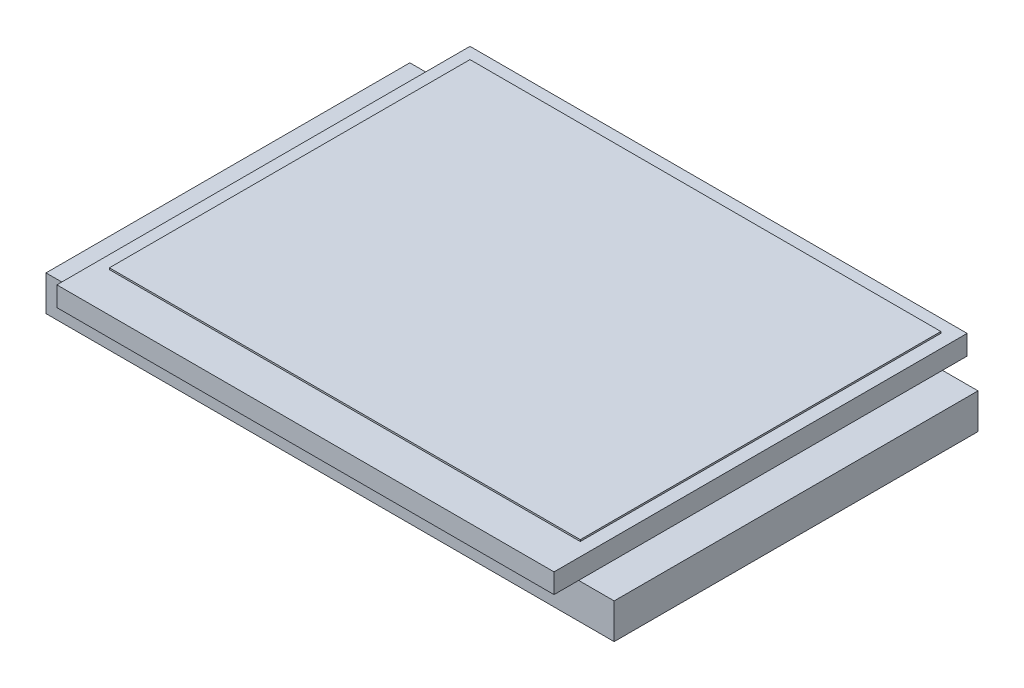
ISO-10303-21;
HEADER;
FILE_DESCRIPTION(('STEP AP214'),'2;1');
FILE_NAME('part.step','',(''),(''),'','','');
FILE_SCHEMA(('AUTOMOTIVE_DESIGN { 1 0 10303 214 1 1 1 1 }'));
ENDSEC;
DATA;
#1=APPLICATION_CONTEXT('core data for automotive mechanical design processes');
#2=APPLICATION_PROTOCOL_DEFINITION('international standard','automotive_design',2000,#1);
#3=PRODUCT_CONTEXT('',#1,'mechanical');
#4=PRODUCT('Part','Part','',(#3));
#5=PRODUCT_RELATED_PRODUCT_CATEGORY('part','',(#4));
#6=PRODUCT_DEFINITION_FORMATION('','',#4);
#7=PRODUCT_DEFINITION_CONTEXT('part definition',#1,'design');
#8=PRODUCT_DEFINITION('design','',#6,#7);
#9=PRODUCT_DEFINITION_SHAPE('','',#8);
#10=(LENGTH_UNIT() NAMED_UNIT(*) SI_UNIT(.MILLI.,.METRE.));
#11=(NAMED_UNIT(*) PLANE_ANGLE_UNIT() SI_UNIT($,.RADIAN.));
#12=(NAMED_UNIT(*) SI_UNIT($,.STERADIAN.) SOLID_ANGLE_UNIT());
#13=UNCERTAINTY_MEASURE_WITH_UNIT(LENGTH_MEASURE(1.E-05),#10,'distance_accuracy_value','');
#14=(GEOMETRIC_REPRESENTATION_CONTEXT(3) GLOBAL_UNCERTAINTY_ASSIGNED_CONTEXT((#13)) GLOBAL_UNIT_ASSIGNED_CONTEXT((#10,
#11,#12)) REPRESENTATION_CONTEXT('',''));
#15=CARTESIAN_POINT('',(0.,0.,0.));
#16=DIRECTION('',(0.,0.,1.));
#17=DIRECTION('',(1.,0.,0.));
#18=AXIS2_PLACEMENT_3D('',#15,#16,#17);
#19=CARTESIAN_POINT('',(0.,0.,0.));
#20=DIRECTION('',(0.,1.,0.));
#21=DIRECTION('',(0.,0.,1.));
#22=AXIS2_PLACEMENT_3D('',#19,#20,#21);
#23=PLANE('',#22);
#24=DIRECTION('',(1.,0.,0.));
#25=VECTOR('',#24,1.);
#26=CARTESIAN_POINT('',(-43.942,0.,-28.1400000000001));
#27=LINE('',#26,#25);
#28=CARTESIAN_POINT('',(-38.4499999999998,0.,-28.1400000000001));
#29=VERTEX_POINT('',#28);
#30=CARTESIAN_POINT('',(38.4500000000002,0.,-28.1400000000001));
#31=VERTEX_POINT('',#30);
#32=EDGE_CURVE('E11',#29,#31,#27,.T.);
#33=ORIENTED_EDGE('',*,*,#32,.F.);
#34=DIRECTION('',(0.,0.,1.));
#35=VECTOR('',#34,1.);
#36=CARTESIAN_POINT('',(-38.4499999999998,0.,31.9499999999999));
#37=LINE('',#36,#35);
#38=CARTESIAN_POINT('',(-38.4499999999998,0.,-31.9500000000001));
#39=VERTEX_POINT('',#38);
#40=EDGE_CURVE('E212',#39,#29,#37,.T.);
#41=ORIENTED_EDGE('',*,*,#40,.F.);
#42=DIRECTION('',(-1.,0.,0.));
#43=VECTOR('',#42,1.);
#44=CARTESIAN_POINT('',(38.4500000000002,0.,-31.9500000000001));
#45=LINE('',#44,#43);
#46=CARTESIAN_POINT('',(38.4500000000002,0.,-31.9500000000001));
#47=VERTEX_POINT('',#46);
#48=EDGE_CURVE('E205',#47,#39,#45,.T.);
#49=ORIENTED_EDGE('',*,*,#48,.F.);
#50=DIRECTION('',(0.,0.,-1.));
#51=VECTOR('',#50,1.);
#52=CARTESIAN_POINT('',(38.4500000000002,0.,31.9499999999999));
#53=LINE('',#52,#51);
#54=EDGE_CURVE('E54',#31,#47,#53,.T.);
#55=ORIENTED_EDGE('',*,*,#54,.F.);
#56=EDGE_LOOP('',(#33,#41,#49,#55));
#57=FACE_BOUND('',#56,.T.);
#58=ADVANCED_FACE('F35',(#57),#23,.F.);
#59=DIRECTION('',(-1.,0.,0.));
#60=VECTOR('',#59,1.);
#61=CARTESIAN_POINT('',(-43.942,0.,28.1399999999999));
#62=LINE('',#61,#60);
#63=CARTESIAN_POINT('',(38.4500000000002,0.,28.1399999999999));
#64=VERTEX_POINT('',#63);
#65=CARTESIAN_POINT('',(-38.4499999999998,0.,28.1399999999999));
#66=VERTEX_POINT('',#65);
#67=EDGE_CURVE('E44',#64,#66,#62,.T.);
#68=ORIENTED_EDGE('',*,*,#67,.F.);
#69=CARTESIAN_POINT('',(38.4500000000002,0.,31.9499999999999));
#70=VERTEX_POINT('',#69);
#71=EDGE_CURVE('E218',#70,#64,#53,.T.);
#72=ORIENTED_EDGE('',*,*,#71,.F.);
#73=DIRECTION('',(1.,0.,0.));
#74=VECTOR('',#73,1.);
#75=CARTESIAN_POINT('',(38.4500000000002,0.,31.9499999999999));
#76=LINE('',#75,#74);
#77=CARTESIAN_POINT('',(-38.4499999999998,0.,31.9499999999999));
#78=VERTEX_POINT('',#77);
#79=EDGE_CURVE('E215',#78,#70,#76,.T.);
#80=ORIENTED_EDGE('',*,*,#79,.F.);
#81=EDGE_CURVE('E200',#66,#78,#37,.T.);
#82=ORIENTED_EDGE('',*,*,#81,.F.);
#83=EDGE_LOOP('',(#68,#72,#80,#82));
#84=FACE_BOUND('',#83,.T.);
#85=ADVANCED_FACE('F261',(#84),#23,.F.);
#86=CARTESIAN_POINT('',(0.,3.048,0.));
#87=DIRECTION('',(0.,1.,0.));
#88=DIRECTION('',(0.,0.,1.));
#89=AXIS2_PLACEMENT_3D('',#86,#87,#88);
#90=PLANE('',#89);
#91=DIRECTION('',(0.,0.,1.));
#92=VECTOR('',#91,1.);
#93=CARTESIAN_POINT('',(-38.4499999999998,3.048,31.9499999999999));
#94=LINE('',#93,#92);
#95=CARTESIAN_POINT('',(-38.4499999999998,3.048,-31.9500000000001));
#96=VERTEX_POINT('',#95);
#97=CARTESIAN_POINT('',(-38.4499999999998,3.048,31.9499999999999));
#98=VERTEX_POINT('',#97);
#99=EDGE_CURVE('E201',#96,#98,#94,.T.);
#100=ORIENTED_EDGE('',*,*,#99,.T.);
#101=DIRECTION('',(1.,0.,0.));
#102=VECTOR('',#101,1.);
#103=CARTESIAN_POINT('',(38.4500000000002,3.048,31.9499999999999));
#104=LINE('',#103,#102);
#105=CARTESIAN_POINT('',(38.4500000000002,3.048,31.9499999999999));
#106=VERTEX_POINT('',#105);
#107=EDGE_CURVE('E204',#98,#106,#104,.T.);
#108=ORIENTED_EDGE('',*,*,#107,.T.);
#109=DIRECTION('',(0.,0.,-1.));
#110=VECTOR('',#109,1.);
#111=CARTESIAN_POINT('',(38.4500000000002,3.048,31.9499999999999));
#112=LINE('',#111,#110);
#113=CARTESIAN_POINT('',(38.4500000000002,3.048,-31.9500000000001));
#114=VERTEX_POINT('',#113);
#115=EDGE_CURVE('E207',#106,#114,#112,.T.);
#116=ORIENTED_EDGE('',*,*,#115,.T.);
#117=DIRECTION('',(-1.,0.,0.));
#118=VECTOR('',#117,1.);
#119=CARTESIAN_POINT('',(38.4500000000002,3.048,-31.9500000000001));
#120=LINE('',#119,#118);
#121=EDGE_CURVE('E209',#114,#96,#120,.T.);
#122=ORIENTED_EDGE('',*,*,#121,.T.);
#123=EDGE_LOOP('',(#100,#108,#116,#122));
#124=FACE_BOUND('',#123,.T.);
#125=DIRECTION('',(-1.,0.,0.));
#126=VECTOR('',#125,1.);
#127=CARTESIAN_POINT('',(-36.4179999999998,3.048,-29.9180000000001));
#128=LINE('',#127,#126);
#129=CARTESIAN_POINT('',(36.4180000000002,3.048,-29.9180000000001));
#130=VERTEX_POINT('',#129);
#131=CARTESIAN_POINT('',(-36.4179999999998,3.048,-29.9180000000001));
#132=VERTEX_POINT('',#131);
#133=EDGE_CURVE('E169',#130,#132,#128,.T.);
#134=ORIENTED_EDGE('',*,*,#133,.F.);
#135=DIRECTION('',(0.,0.,-1.));
#136=VECTOR('',#135,1.);
#137=CARTESIAN_POINT('',(36.4180000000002,3.048,-29.9180000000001));
#138=LINE('',#137,#136);
#139=CARTESIAN_POINT('',(36.4180000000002,3.048,25.8539999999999));
#140=VERTEX_POINT('',#139);
#141=EDGE_CURVE('E166',#140,#130,#138,.T.);
#142=ORIENTED_EDGE('',*,*,#141,.F.);
#143=DIRECTION('',(1.,0.,0.));
#144=VECTOR('',#143,1.);
#145=CARTESIAN_POINT('',(-36.4179999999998,3.048,25.8539999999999));
#146=LINE('',#145,#144);
#147=CARTESIAN_POINT('',(-36.4179999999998,3.048,25.8539999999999));
#148=VERTEX_POINT('',#147);
#149=EDGE_CURVE('E179',#148,#140,#146,.T.);
#150=ORIENTED_EDGE('',*,*,#149,.F.);
#151=DIRECTION('',(0.,0.,1.));
#152=VECTOR('',#151,1.);
#153=CARTESIAN_POINT('',(-36.4179999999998,3.048,-29.9180000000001));
#154=LINE('',#153,#152);
#155=EDGE_CURVE('E187',#132,#148,#154,.T.);
#156=ORIENTED_EDGE('',*,*,#155,.F.);
#157=EDGE_LOOP('',(#134,#142,#150,#156));
#158=FACE_BOUND('',#157,.T.);
#159=ADVANCED_FACE('F267',(#124,#158),#90,.T.);
#160=CARTESIAN_POINT('',(-38.4499999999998,3.048,31.9499999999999));
#161=DIRECTION('',(1.,0.,0.));
#162=DIRECTION('',(0.,0.,-1.));
#163=AXIS2_PLACEMENT_3D('',#160,#161,#162);
#164=PLANE('',#163);
#165=ORIENTED_EDGE('',*,*,#40,.T.);
#166=EDGE_CURVE('E216',#29,#66,#37,.T.);
#167=ORIENTED_EDGE('',*,*,#166,.T.);
#168=ORIENTED_EDGE('',*,*,#81,.T.);
#169=DIRECTION('',(0.,-1.,0.));
#170=VECTOR('',#169,1.);
#171=CARTESIAN_POINT('',(-38.4499999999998,3.048,31.9499999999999));
#172=LINE('',#171,#170);
#173=EDGE_CURVE('E39',#98,#78,#172,.T.);
#174=ORIENTED_EDGE('',*,*,#173,.F.);
#175=ORIENTED_EDGE('',*,*,#99,.F.);
#176=DIRECTION('',(0.,-1.,0.));
#177=VECTOR('',#176,1.);
#178=CARTESIAN_POINT('',(-38.4499999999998,3.048,-31.9500000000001));
#179=LINE('',#178,#177);
#180=EDGE_CURVE('E211',#96,#39,#179,.T.);
#181=ORIENTED_EDGE('',*,*,#180,.T.);
#182=EDGE_LOOP('',(#165,#167,#168,#174,#175,#181));
#183=FACE_BOUND('',#182,.T.);
#184=ADVANCED_FACE('F37',(#183),#164,.F.);
#185=CARTESIAN_POINT('',(38.4500000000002,3.048,31.9499999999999));
#186=DIRECTION('',(0.,0.,-1.));
#187=DIRECTION('',(-1.,0.,0.));
#188=AXIS2_PLACEMENT_3D('',#185,#186,#187);
#189=PLANE('',#188);
#190=ORIENTED_EDGE('',*,*,#79,.T.);
#191=DIRECTION('',(0.,-1.,0.));
#192=VECTOR('',#191,1.);
#193=CARTESIAN_POINT('',(38.4500000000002,3.048,31.9499999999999));
#194=LINE('',#193,#192);
#195=EDGE_CURVE('E226',#106,#70,#194,.T.);
#196=ORIENTED_EDGE('',*,*,#195,.F.);
#197=ORIENTED_EDGE('',*,*,#107,.F.);
#198=ORIENTED_EDGE('',*,*,#173,.T.);
#199=EDGE_LOOP('',(#190,#196,#197,#198));
#200=FACE_BOUND('',#199,.T.);
#201=ADVANCED_FACE('F262',(#200),#189,.F.);
#202=CARTESIAN_POINT('',(38.4500000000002,3.048,31.9499999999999));
#203=DIRECTION('',(-1.,0.,0.));
#204=DIRECTION('',(0.,0.,1.));
#205=AXIS2_PLACEMENT_3D('',#202,#203,#204);
#206=PLANE('',#205);
#207=ORIENTED_EDGE('',*,*,#71,.T.);
#208=EDGE_CURVE('E220',#64,#31,#53,.T.);
#209=ORIENTED_EDGE('',*,*,#208,.T.);
#210=ORIENTED_EDGE('',*,*,#54,.T.);
#211=DIRECTION('',(0.,-1.,0.));
#212=VECTOR('',#211,1.);
#213=CARTESIAN_POINT('',(38.4500000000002,3.048,-31.9500000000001));
#214=LINE('',#213,#212);
#215=EDGE_CURVE('E224',#114,#47,#214,.T.);
#216=ORIENTED_EDGE('',*,*,#215,.F.);
#217=ORIENTED_EDGE('',*,*,#115,.F.);
#218=ORIENTED_EDGE('',*,*,#195,.T.);
#219=EDGE_LOOP('',(#207,#209,#210,#216,#217,#218));
#220=FACE_BOUND('',#219,.T.);
#221=ADVANCED_FACE('F264',(#220),#206,.F.);
#222=CARTESIAN_POINT('',(38.4500000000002,3.048,-31.9500000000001));
#223=DIRECTION('',(0.,0.,1.));
#224=DIRECTION('',(1.,0.,0.));
#225=AXIS2_PLACEMENT_3D('',#222,#223,#224);
#226=PLANE('',#225);
#227=ORIENTED_EDGE('',*,*,#48,.T.);
#228=ORIENTED_EDGE('',*,*,#180,.F.);
#229=ORIENTED_EDGE('',*,*,#121,.F.);
#230=ORIENTED_EDGE('',*,*,#215,.T.);
#231=EDGE_LOOP('',(#227,#228,#229,#230));
#232=FACE_BOUND('',#231,.T.);
#233=ADVANCED_FACE('F272',(#232),#226,.F.);
#234=CARTESIAN_POINT('',(36.4180000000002,3.302,-29.9180000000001));
#235=DIRECTION('',(-1.,0.,0.));
#236=DIRECTION('',(0.,0.,1.));
#237=AXIS2_PLACEMENT_3D('',#234,#235,#236);
#238=PLANE('',#237);
#239=ORIENTED_EDGE('',*,*,#141,.T.);
#240=DIRECTION('',(0.,-1.,0.));
#241=VECTOR('',#240,1.);
#242=CARTESIAN_POINT('',(36.4180000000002,3.302,-29.9180000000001));
#243=LINE('',#242,#241);
#244=CARTESIAN_POINT('',(36.4180000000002,3.302,-29.9180000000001));
#245=VERTEX_POINT('',#244);
#246=EDGE_CURVE('E198',#245,#130,#243,.T.);
#247=ORIENTED_EDGE('',*,*,#246,.F.);
#248=DIRECTION('',(0.,0.,-1.));
#249=VECTOR('',#248,1.);
#250=CARTESIAN_POINT('',(36.4180000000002,3.302,-29.9180000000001));
#251=LINE('',#250,#249);
#252=CARTESIAN_POINT('',(36.4180000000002,3.302,25.8539999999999));
#253=VERTEX_POINT('',#252);
#254=EDGE_CURVE('E175',#253,#245,#251,.T.);
#255=ORIENTED_EDGE('',*,*,#254,.F.);
#256=DIRECTION('',(0.,-1.,0.));
#257=VECTOR('',#256,1.);
#258=CARTESIAN_POINT('',(36.4180000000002,3.302,25.8539999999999));
#259=LINE('',#258,#257);
#260=EDGE_CURVE('E184',#253,#140,#259,.T.);
#261=ORIENTED_EDGE('',*,*,#260,.T.);
#262=EDGE_LOOP('',(#239,#247,#255,#261));
#263=FACE_BOUND('',#262,.T.);
#264=ADVANCED_FACE('F274',(#263),#238,.F.);
#265=CARTESIAN_POINT('',(-36.4179999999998,3.302,-29.9180000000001));
#266=DIRECTION('',(0.,0.,1.));
#267=DIRECTION('',(1.,0.,0.));
#268=AXIS2_PLACEMENT_3D('',#265,#266,#267);
#269=PLANE('',#268);
#270=ORIENTED_EDGE('',*,*,#133,.T.);
#271=DIRECTION('',(0.,-1.,0.));
#272=VECTOR('',#271,1.);
#273=CARTESIAN_POINT('',(-36.4179999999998,3.302,-29.9180000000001));
#274=LINE('',#273,#272);
#275=CARTESIAN_POINT('',(-36.4179999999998,3.302,-29.9180000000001));
#276=VERTEX_POINT('',#275);
#277=EDGE_CURVE('E195',#276,#132,#274,.T.);
#278=ORIENTED_EDGE('',*,*,#277,.F.);
#279=DIRECTION('',(-1.,0.,0.));
#280=VECTOR('',#279,1.);
#281=CARTESIAN_POINT('',(-36.4179999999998,3.302,-29.9180000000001));
#282=LINE('',#281,#280);
#283=EDGE_CURVE('E178',#245,#276,#282,.T.);
#284=ORIENTED_EDGE('',*,*,#283,.F.);
#285=ORIENTED_EDGE('',*,*,#246,.T.);
#286=EDGE_LOOP('',(#270,#278,#284,#285));
#287=FACE_BOUND('',#286,.T.);
#288=ADVANCED_FACE('F280',(#287),#269,.F.);
#289=CARTESIAN_POINT('',(-36.4179999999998,3.302,-29.9180000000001));
#290=DIRECTION('',(1.,0.,0.));
#291=DIRECTION('',(0.,0.,-1.));
#292=AXIS2_PLACEMENT_3D('',#289,#290,#291);
#293=PLANE('',#292);
#294=ORIENTED_EDGE('',*,*,#155,.T.);
#295=DIRECTION('',(0.,-1.,0.));
#296=VECTOR('',#295,1.);
#297=CARTESIAN_POINT('',(-36.4179999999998,3.302,25.8539999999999));
#298=LINE('',#297,#296);
#299=CARTESIAN_POINT('',(-36.4179999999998,3.302,25.8539999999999));
#300=VERTEX_POINT('',#299);
#301=EDGE_CURVE('E193',#300,#148,#298,.T.);
#302=ORIENTED_EDGE('',*,*,#301,.F.);
#303=DIRECTION('',(0.,0.,1.));
#304=VECTOR('',#303,1.);
#305=CARTESIAN_POINT('',(-36.4179999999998,3.302,-29.9180000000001));
#306=LINE('',#305,#304);
#307=EDGE_CURVE('E181',#276,#300,#306,.T.);
#308=ORIENTED_EDGE('',*,*,#307,.F.);
#309=ORIENTED_EDGE('',*,*,#277,.T.);
#310=EDGE_LOOP('',(#294,#302,#308,#309));
#311=FACE_BOUND('',#310,.T.);
#312=ADVANCED_FACE('F294',(#311),#293,.F.);
#313=CARTESIAN_POINT('',(-36.4179999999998,3.302,25.8539999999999));
#314=DIRECTION('',(0.,0.,-1.));
#315=DIRECTION('',(-1.,0.,0.));
#316=AXIS2_PLACEMENT_3D('',#313,#314,#315);
#317=PLANE('',#316);
#318=ORIENTED_EDGE('',*,*,#149,.T.);
#319=ORIENTED_EDGE('',*,*,#260,.F.);
#320=DIRECTION('',(1.,0.,0.));
#321=VECTOR('',#320,1.);
#322=CARTESIAN_POINT('',(-36.4179999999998,3.302,25.8539999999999));
#323=LINE('',#322,#321);
#324=EDGE_CURVE('E183',#300,#253,#323,.T.);
#325=ORIENTED_EDGE('',*,*,#324,.F.);
#326=ORIENTED_EDGE('',*,*,#301,.T.);
#327=EDGE_LOOP('',(#318,#319,#325,#326));
#328=FACE_BOUND('',#327,.T.);
#329=ADVANCED_FACE('F298',(#328),#317,.F.);
#330=CARTESIAN_POINT('',(0.,3.302,0.));
#331=DIRECTION('',(0.,1.,0.));
#332=DIRECTION('',(0.,0.,1.));
#333=AXIS2_PLACEMENT_3D('',#330,#331,#332);
#334=PLANE('',#333);
#335=ORIENTED_EDGE('',*,*,#254,.T.);
#336=ORIENTED_EDGE('',*,*,#283,.T.);
#337=ORIENTED_EDGE('',*,*,#307,.T.);
#338=ORIENTED_EDGE('',*,*,#324,.T.);
#339=EDGE_LOOP('',(#335,#336,#337,#338));
#340=FACE_BOUND('',#339,.T.);
#341=ADVANCED_FACE('F302',(#340),#334,.T.);
#342=CARTESIAN_POINT('',(0.,0.,0.));
#343=DIRECTION('',(0.,-1.,0.));
#344=DIRECTION('',(0.,0.,-1.));
#345=AXIS2_PLACEMENT_3D('',#342,#343,#344);
#346=PLANE('',#345);
#347=ORIENTED_EDGE('',*,*,#166,.F.);
#348=CARTESIAN_POINT('',(-43.942,0.,-28.1400000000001));
#349=VERTEX_POINT('',#348);
#350=EDGE_CURVE('E46',#349,#29,#27,.T.);
#351=ORIENTED_EDGE('',*,*,#350,.F.);
#352=DIRECTION('',(0.,0.,-1.));
#353=VECTOR('',#352,1.);
#354=CARTESIAN_POINT('',(-43.942,0.,28.1399999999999));
#355=LINE('',#354,#353);
#356=CARTESIAN_POINT('',(-43.942,0.,28.1399999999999));
#357=VERTEX_POINT('',#356);
#358=EDGE_CURVE('E239',#357,#349,#355,.T.);
#359=ORIENTED_EDGE('',*,*,#358,.F.);
#360=EDGE_CURVE('E236',#66,#357,#62,.T.);
#361=ORIENTED_EDGE('',*,*,#360,.F.);
#362=EDGE_LOOP('',(#347,#351,#359,#361));
#363=FACE_BOUND('',#362,.T.);
#364=ADVANCED_FACE('F257',(#363),#346,.F.);
#365=CARTESIAN_POINT('',(43.942,-5.461,28.1399999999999));
#366=DIRECTION('',(-1.,0.,0.));
#367=DIRECTION('',(0.,0.,1.));
#368=AXIS2_PLACEMENT_3D('',#365,#366,#367);
#369=PLANE('',#368);
#370=DIRECTION('',(0.,0.,1.));
#371=VECTOR('',#370,1.);
#372=CARTESIAN_POINT('',(43.942,0.,28.1399999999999));
#373=LINE('',#372,#371);
#374=CARTESIAN_POINT('',(43.942,0.,-28.1400000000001));
#375=VERTEX_POINT('',#374);
#376=CARTESIAN_POINT('',(43.942,0.,28.1399999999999));
#377=VERTEX_POINT('',#376);
#378=EDGE_CURVE('E165',#375,#377,#373,.T.);
#379=ORIENTED_EDGE('',*,*,#378,.T.);
#380=DIRECTION('',(0.,1.,0.));
#381=VECTOR('',#380,1.);
#382=CARTESIAN_POINT('',(43.942,-5.461,28.1399999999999));
#383=LINE('',#382,#381);
#384=CARTESIAN_POINT('',(43.942,-5.461,28.1399999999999));
#385=VERTEX_POINT('',#384);
#386=EDGE_CURVE('E146',#385,#377,#383,.T.);
#387=ORIENTED_EDGE('',*,*,#386,.F.);
#388=DIRECTION('',(0.,0.,1.));
#389=VECTOR('',#388,1.);
#390=CARTESIAN_POINT('',(43.942,-5.461,28.1399999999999));
#391=LINE('',#390,#389);
#392=CARTESIAN_POINT('',(43.942,-5.461,-28.1400000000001));
#393=VERTEX_POINT('',#392);
#394=EDGE_CURVE('E153',#393,#385,#391,.T.);
#395=ORIENTED_EDGE('',*,*,#394,.F.);
#396=DIRECTION('',(0.,1.,0.));
#397=VECTOR('',#396,1.);
#398=CARTESIAN_POINT('',(43.942,-5.461,-28.1400000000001));
#399=LINE('',#398,#397);
#400=EDGE_CURVE('E243',#393,#375,#399,.T.);
#401=ORIENTED_EDGE('',*,*,#400,.T.);
#402=EDGE_LOOP('',(#379,#387,#395,#401));
#403=FACE_BOUND('',#402,.T.);
#404=ADVANCED_FACE('F163',(#403),#369,.F.);
#405=CARTESIAN_POINT('',(-43.942,-5.461,28.1399999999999));
#406=DIRECTION('',(0.,0.,-1.));
#407=DIRECTION('',(-1.,0.,0.));
#408=AXIS2_PLACEMENT_3D('',#405,#406,#407);
#409=PLANE('',#408);
#410=EDGE_CURVE('E235',#377,#64,#62,.T.);
#411=ORIENTED_EDGE('',*,*,#410,.T.);
#412=ORIENTED_EDGE('',*,*,#67,.T.);
#413=ORIENTED_EDGE('',*,*,#360,.T.);
#414=DIRECTION('',(0.,1.,0.));
#415=VECTOR('',#414,1.);
#416=CARTESIAN_POINT('',(-43.942,-5.461,28.1399999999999));
#417=LINE('',#416,#415);
#418=CARTESIAN_POINT('',(-43.942,-5.461,28.1399999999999));
#419=VERTEX_POINT('',#418);
#420=EDGE_CURVE('E149',#419,#357,#417,.T.);
#421=ORIENTED_EDGE('',*,*,#420,.F.);
#422=DIRECTION('',(-1.,0.,0.));
#423=VECTOR('',#422,1.);
#424=CARTESIAN_POINT('',(-43.942,-5.461,28.1399999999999));
#425=LINE('',#424,#423);
#426=EDGE_CURVE('E141',#385,#419,#425,.T.);
#427=ORIENTED_EDGE('',*,*,#426,.F.);
#428=ORIENTED_EDGE('',*,*,#386,.T.);
#429=EDGE_LOOP('',(#411,#412,#413,#421,#427,#428));
#430=FACE_BOUND('',#429,.T.);
#431=ADVANCED_FACE('F144',(#430),#409,.F.);
#432=CARTESIAN_POINT('',(-43.942,-5.461,28.1399999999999));
#433=DIRECTION('',(1.,0.,0.));
#434=DIRECTION('',(0.,0.,-1.));
#435=AXIS2_PLACEMENT_3D('',#432,#433,#434);
#436=PLANE('',#435);
#437=ORIENTED_EDGE('',*,*,#358,.T.);
#438=DIRECTION('',(0.,1.,0.));
#439=VECTOR('',#438,1.);
#440=CARTESIAN_POINT('',(-43.942,-5.461,-28.1400000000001));
#441=LINE('',#440,#439);
#442=CARTESIAN_POINT('',(-43.942,-5.461,-28.1400000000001));
#443=VERTEX_POINT('',#442);
#444=EDGE_CURVE('E171',#443,#349,#441,.T.);
#445=ORIENTED_EDGE('',*,*,#444,.F.);
#446=DIRECTION('',(0.,0.,-1.));
#447=VECTOR('',#446,1.);
#448=CARTESIAN_POINT('',(-43.942,-5.461,28.1399999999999));
#449=LINE('',#448,#447);
#450=EDGE_CURVE('E152',#419,#443,#449,.T.);
#451=ORIENTED_EDGE('',*,*,#450,.F.);
#452=ORIENTED_EDGE('',*,*,#420,.T.);
#453=EDGE_LOOP('',(#437,#445,#451,#452));
#454=FACE_BOUND('',#453,.T.);
#455=ADVANCED_FACE('F247',(#454),#436,.F.);
#456=CARTESIAN_POINT('',(-43.942,-5.461,-28.1400000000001));
#457=DIRECTION('',(0.,0.,1.));
#458=DIRECTION('',(1.,0.,0.));
#459=AXIS2_PLACEMENT_3D('',#456,#457,#458);
#460=PLANE('',#459);
#461=ORIENTED_EDGE('',*,*,#350,.T.);
#462=ORIENTED_EDGE('',*,*,#32,.T.);
#463=EDGE_CURVE('E47',#31,#375,#27,.T.);
#464=ORIENTED_EDGE('',*,*,#463,.T.);
#465=ORIENTED_EDGE('',*,*,#400,.F.);
#466=DIRECTION('',(1.,0.,0.));
#467=VECTOR('',#466,1.);
#468=CARTESIAN_POINT('',(-43.942,-5.461,-28.1400000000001));
#469=LINE('',#468,#467);
#470=EDGE_CURVE('E158',#443,#393,#469,.T.);
#471=ORIENTED_EDGE('',*,*,#470,.F.);
#472=ORIENTED_EDGE('',*,*,#444,.T.);
#473=EDGE_LOOP('',(#461,#462,#464,#465,#471,#472));
#474=FACE_BOUND('',#473,.T.);
#475=ADVANCED_FACE('F252',(#474),#460,.F.);
#476=CARTESIAN_POINT('',(0.,-5.461,0.));
#477=DIRECTION('',(0.,-1.,0.));
#478=DIRECTION('',(0.,0.,-1.));
#479=AXIS2_PLACEMENT_3D('',#476,#477,#478);
#480=PLANE('',#479);
#481=ORIENTED_EDGE('',*,*,#394,.T.);
#482=ORIENTED_EDGE('',*,*,#426,.T.);
#483=ORIENTED_EDGE('',*,*,#450,.T.);
#484=ORIENTED_EDGE('',*,*,#470,.T.);
#485=EDGE_LOOP('',(#481,#482,#483,#484));
#486=FACE_BOUND('',#485,.T.);
#487=ADVANCED_FACE('F156',(#486),#480,.T.);
#488=ORIENTED_EDGE('',*,*,#208,.F.);
#489=ORIENTED_EDGE('',*,*,#410,.F.);
#490=ORIENTED_EDGE('',*,*,#378,.F.);
#491=ORIENTED_EDGE('',*,*,#463,.F.);
#492=EDGE_LOOP('',(#488,#489,#490,#491));
#493=FACE_BOUND('',#492,.T.);
#494=ADVANCED_FACE('F315',(#493),#346,.F.);
#495=CLOSED_SHELL('',(#58,#85,#159,#184,#201,#221,#233,#264,#288,#312,#329,#341,#364,#404,#431,
#455,#475,#487,#494));
#496=MANIFOLD_SOLID_BREP('B2',#495);
#497=ADVANCED_BREP_SHAPE_REPRESENTATION('',(#18,#496),#14);
#498=SHAPE_DEFINITION_REPRESENTATION(#9,#497);
ENDSEC;
END-ISO-10303-21;
